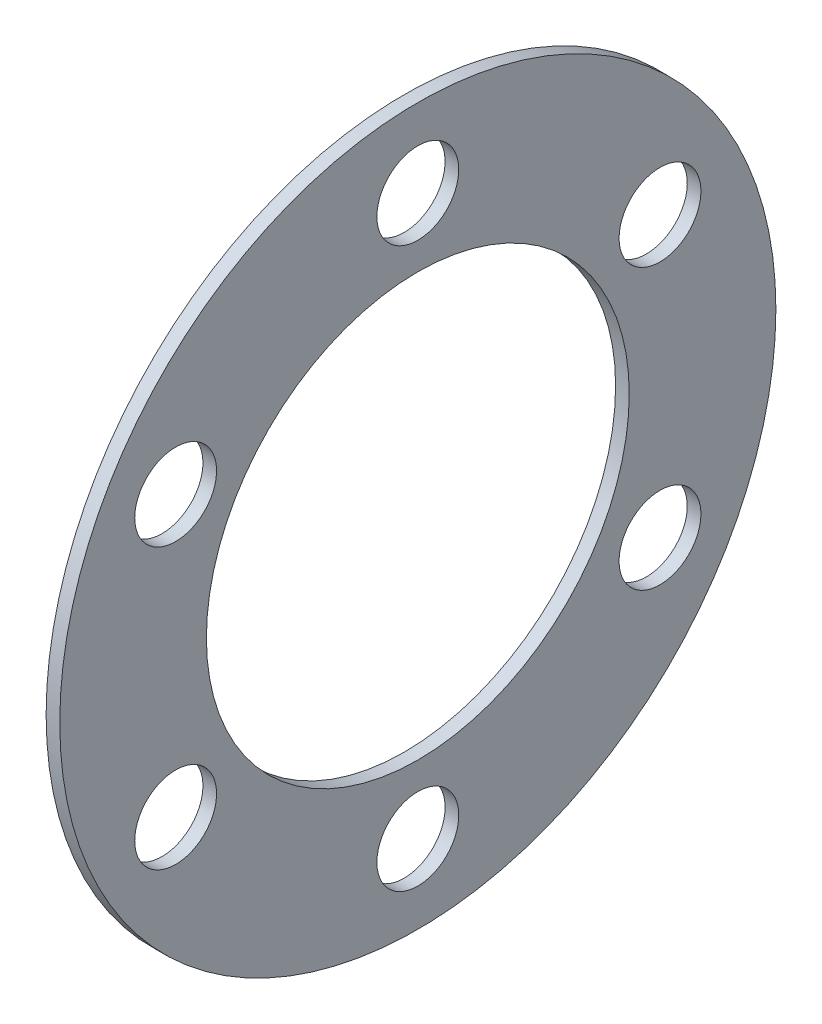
from build123d import *

# Parameters (mm, degrees)
SKETCH2_W          = 2
SKETCH2_H          = 52.5
CUT_EXTRUDE1_REACH = 76.273
SKETCH5_R          = 6
CUT_EXTRUDE2_REACH = 76.273
SKETCH6_R          = 31
CIRPATTERN2_COUNT  = 6


with BuildPart() as part:
    # Sketch2 → Revolve1 (revolve)
    with BuildSketch(Plane.XY, mode=Mode.PRIVATE) as revolve1_sk:
        with Locations((1, 26.25)):
            Rectangle(SKETCH2_W, SKETCH2_H)
    revolve(revolve1_sk.sketch.rotate(Axis((29.906992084, 0, 0), (-1, 0, 0)), 90), axis=Axis((29.906992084, 0, 0), (-1, 0, 0)))

    # Sketch5 → Cut-Extrude1 (cut, up to next)
    with BuildSketch(Plane.ZY, mode=Mode.PRIVATE) as cut_extrude1_sk1:
        with Locations((0, 41)):
            Circle(SKETCH5_R)
    cut_extrude1_tool1 = extrude(cut_extrude1_sk1.sketch, amount=-CUT_EXTRUDE1_REACH, mode=Mode.PRIVATE) & part.part
    cut_extrude1 = cut_extrude1_tool1.solids().sort_by_distance((0, 41, 0))[0]
    add(cut_extrude1, mode=Mode.SUBTRACT)

    # Sketch6 → Cut-Extrude2 (cut, up to next)
    with BuildSketch(Plane.ZY, mode=Mode.PRIVATE) as cut_extrude2_sk1:
        Circle(SKETCH6_R)
    cut_extrude2_tool1 = extrude(cut_extrude2_sk1.sketch, amount=-CUT_EXTRUDE2_REACH, mode=Mode.PRIVATE) & part.part
    add(cut_extrude2_tool1.solids().sort_by_distance((0, 0, 0))[0], mode=Mode.SUBTRACT)

    # CirPattern2: Cut-Extrude1 ×6 about axis
    cirpattern2_axis = Axis((0, 0, 0), (1, 0, 0))
    for i in range(1, CIRPATTERN2_COUNT):
        add(cut_extrude1.rotate(cirpattern2_axis, i * 360 / CIRPATTERN2_COUNT), mode=Mode.SUBTRACT)


solid = part.part
